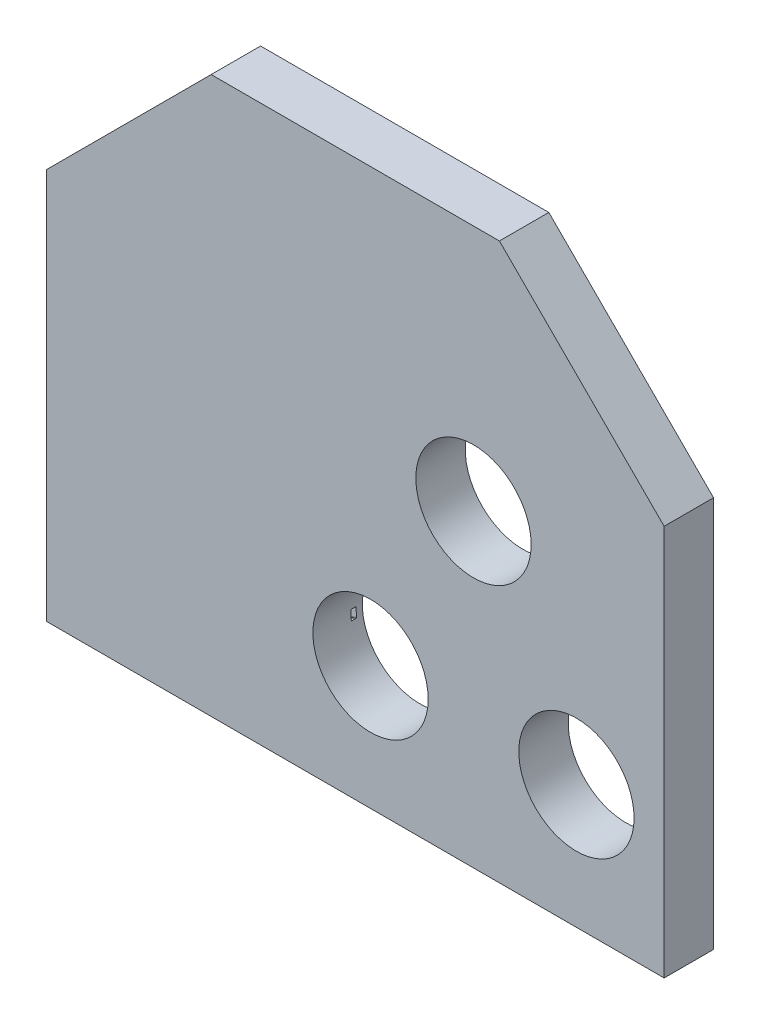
ISO-10303-21;
HEADER;
FILE_DESCRIPTION(('STEP AP214'),'2;1');
FILE_NAME('part.step','',(''),(''),'','','');
FILE_SCHEMA(('AUTOMOTIVE_DESIGN { 1 0 10303 214 1 1 1 1 }'));
ENDSEC;
DATA;
#1=APPLICATION_CONTEXT('core data for automotive mechanical design processes');
#2=APPLICATION_PROTOCOL_DEFINITION('international standard','automotive_design',2000,#1);
#3=PRODUCT_CONTEXT('',#1,'mechanical');
#4=PRODUCT('Part','Part','',(#3));
#5=PRODUCT_RELATED_PRODUCT_CATEGORY('part','',(#4));
#6=PRODUCT_DEFINITION_FORMATION('','',#4);
#7=PRODUCT_DEFINITION_CONTEXT('part definition',#1,'design');
#8=PRODUCT_DEFINITION('design','',#6,#7);
#9=PRODUCT_DEFINITION_SHAPE('','',#8);
#10=(LENGTH_UNIT() NAMED_UNIT(*) SI_UNIT(.MILLI.,.METRE.));
#11=(NAMED_UNIT(*) PLANE_ANGLE_UNIT() SI_UNIT($,.RADIAN.));
#12=(NAMED_UNIT(*) SI_UNIT($,.STERADIAN.) SOLID_ANGLE_UNIT());
#13=UNCERTAINTY_MEASURE_WITH_UNIT(LENGTH_MEASURE(1.E-05),#10,'distance_accuracy_value','');
#14=(GEOMETRIC_REPRESENTATION_CONTEXT(3) GLOBAL_UNCERTAINTY_ASSIGNED_CONTEXT((#13)) GLOBAL_UNIT_ASSIGNED_CONTEXT((#10,
#11,#12)) REPRESENTATION_CONTEXT('',''));
#15=CARTESIAN_POINT('',(0.,0.,0.));
#16=DIRECTION('',(0.,0.,1.));
#17=DIRECTION('',(1.,0.,0.));
#18=AXIS2_PLACEMENT_3D('',#15,#16,#17);
#19=CARTESIAN_POINT('',(78.7,30.,0.));
#20=DIRECTION('',(0.,0.,1.));
#21=DIRECTION('',(1.,0.,0.));
#22=AXIS2_PLACEMENT_3D('',#19,#20,#21);
#23=CYLINDRICAL_SURFACE('',#22,14.);
#24=DIRECTION('',(0.,0.,1.));
#25=VECTOR('',#24,1.);
#26=CARTESIAN_POINT('',(85.4728224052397,42.2527089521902,2.15));
#27=LINE('',#26,#25);
#28=CARTESIAN_POINT('',(85.4728224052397,42.2527089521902,1.5));
#29=VERTEX_POINT('',#28);
#30=CARTESIAN_POINT('',(85.4728224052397,42.2527089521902,2.8));
#31=VERTEX_POINT('',#30);
#32=EDGE_CURVE('E172',#29,#31,#27,.T.);
#33=ORIENTED_EDGE('',*,*,#32,.F.);
#34=CARTESIAN_POINT('',(78.7,30.,1.5));
#35=DIRECTION('',(0.,0.,1.));
#36=DIRECTION('',(1.,0.,0.));
#37=AXIS2_PLACEMENT_3D('',#34,#35,#36);
#38=CIRCLE('',#37,14.);
#39=CARTESIAN_POINT('',(83.5993134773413,43.1147522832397,1.5));
#40=VERTEX_POINT('',#39);
#41=EDGE_CURVE('E194',#40,#29,#38,.F.);
#42=ORIENTED_EDGE('',*,*,#41,.F.);
#43=CARTESIAN_POINT('',(83.4748564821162,43.1605754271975,1.63019999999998));
#44=CARTESIAN_POINT('',(83.4748394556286,43.1605814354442,1.62298749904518));
#45=CARTESIAN_POINT('',(83.4754098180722,43.1603746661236,1.61577663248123));
#46=CARTESIAN_POINT('',(83.4776776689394,43.1595516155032,1.6015671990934));
#47=CARTESIAN_POINT('',(83.4793737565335,43.1589358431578,1.59456837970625));
#48=CARTESIAN_POINT('',(83.4838462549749,43.1573105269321,1.5809711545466));
#49=CARTESIAN_POINT('',(83.4866229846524,43.1563008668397,1.57437286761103));
#50=CARTESIAN_POINT('',(83.4931684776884,43.1539175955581,1.56176125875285));
#51=CARTESIAN_POINT('',(83.4969371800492,43.1525440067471,1.55574790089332));
#52=CARTESIAN_POINT('',(83.5053869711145,43.1494591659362,1.54442227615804));
#53=CARTESIAN_POINT('',(83.5100749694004,43.1477453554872,1.53911586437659));
#54=CARTESIAN_POINT('',(83.5202063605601,43.1440343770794,1.52939774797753));
#55=CARTESIAN_POINT('',(83.5256499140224,43.1420371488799,1.52498623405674));
#56=CARTESIAN_POINT('',(83.5372393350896,43.1377758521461,1.51709974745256));
#57=CARTESIAN_POINT('',(83.5433959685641,43.1355076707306,1.51364282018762));
#58=CARTESIAN_POINT('',(83.5561553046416,43.1307959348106,1.50785687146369));
#59=CARTESIAN_POINT('',(83.5627580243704,43.1283523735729,1.50552789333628));
#60=CARTESIAN_POINT('',(83.5763522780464,43.1233091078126,1.50202074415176));
#61=CARTESIAN_POINT('',(83.5833487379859,43.1207073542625,1.50086459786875));
#62=CARTESIAN_POINT('',(83.5974205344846,43.1154614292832,1.49980612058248));
#63=CARTESIAN_POINT('',(83.6044958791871,43.1128172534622,1.49990392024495));
#64=CARTESIAN_POINT('',(83.6186101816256,43.1075295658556,1.50135807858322));
#65=CARTESIAN_POINT('',(83.625647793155,43.1048864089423,1.50272884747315));
#66=CARTESIAN_POINT('',(83.6394035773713,43.0997078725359,1.5067143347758));
#67=CARTESIAN_POINT('',(83.6461217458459,43.097172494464,1.50932906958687));
#68=CARTESIAN_POINT('',(83.6590359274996,43.0922881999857,1.51573125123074));
#69=CARTESIAN_POINT('',(83.6652326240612,43.0899390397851,1.51951713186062));
#70=CARTESIAN_POINT('',(83.676928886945,43.0854964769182,1.52816348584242));
#71=CARTESIAN_POINT('',(83.6824285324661,43.0834030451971,1.53302383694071));
#72=CARTESIAN_POINT('',(83.6924840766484,43.079569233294,1.54360614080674));
#73=CARTESIAN_POINT('',(83.6970529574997,43.077824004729,1.54931399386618));
#74=CARTESIAN_POINT('',(83.7052063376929,43.0747056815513,1.56148765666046));
#75=CARTESIAN_POINT('',(83.7087906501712,43.0733326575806,1.56795360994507));
#76=CARTESIAN_POINT('',(83.7147895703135,43.0710326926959,1.58130705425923));
#77=CARTESIAN_POINT('',(83.7172278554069,43.0700967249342,1.58818236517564));
#78=CARTESIAN_POINT('',(83.7209637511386,43.0686620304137,1.60226993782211));
#79=CARTESIAN_POINT('',(83.7222632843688,43.0681625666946,1.60948160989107));
#80=CARTESIAN_POINT('',(83.7234146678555,43.067719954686,1.62122203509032));
#81=CARTESIAN_POINT('',(83.7236316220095,43.0676365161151,1.62571238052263));
#82=CARTESIAN_POINT('',(83.723622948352,43.0676398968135,1.6302));
#83=B_SPLINE_CURVE_WITH_KNOTS('',3,(#43,#44,#45,#46,#47,#48,#49,#50,#51,#52,#53,#54,#55,#56,#57,
#58,#59,#60,#61,#62,#63,#64,#65,#66,#67,#68,#69,#70,#71,#72,#73,#74,#75,#76,#77,#78,#79,#80,#81,
#82),.UNSPECIFIED.,.F.,.F.,(4,2,2,2,2,2,2,2,2,2,2,2,2,2,2,2,2,2,2,4),(0.,0.0216072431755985,
0.043187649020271,0.0647744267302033,0.0863598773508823,0.108114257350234,0.129873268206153,
0.152019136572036,0.174165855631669,0.19672117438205,0.219278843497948,0.242095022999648,
0.264911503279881,0.287697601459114,0.310481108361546,0.332921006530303,0.355365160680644,
0.377322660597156,0.39924301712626,0.412705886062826),.UNSPECIFIED.);
#84=CARTESIAN_POINT('',(83.4748563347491,43.1605754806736,1.63));
#85=VERTEX_POINT('',#84);
#86=EDGE_CURVE('E699',#85,#40,#83,.T.);
#87=ORIENTED_EDGE('',*,*,#86,.F.);
#88=DIRECTION('',(0.,0.,1.));
#89=VECTOR('',#88,1.);
#90=CARTESIAN_POINT('',(83.4748563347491,43.1605754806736,2.15));
#91=LINE('',#90,#89);
#92=CARTESIAN_POINT('',(83.4748563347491,43.1605754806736,2.67));
#93=VERTEX_POINT('',#92);
#94=EDGE_CURVE('E316',#93,#85,#91,.F.);
#95=ORIENTED_EDGE('',*,*,#94,.F.);
#96=CARTESIAN_POINT('',(83.723622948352,43.0676398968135,2.6698));
#97=CARTESIAN_POINT('',(83.7236399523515,43.0676331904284,2.67699172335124));
#98=CARTESIAN_POINT('',(83.7230741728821,43.0678508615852,2.68418152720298));
#99=CARTESIAN_POINT('',(83.7208252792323,43.0687151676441,2.69834774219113));
#100=CARTESIAN_POINT('',(83.7191437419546,43.0693611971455,2.70532443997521));
#101=CARTESIAN_POINT('',(83.7147108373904,43.0710627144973,2.71887785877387));
#102=CARTESIAN_POINT('',(83.7119592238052,43.072118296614,2.72545448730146));
#103=CARTESIAN_POINT('',(83.7054741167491,43.0746028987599,2.73802638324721));
#104=CARTESIAN_POINT('',(83.7017406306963,43.0760319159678,2.74402165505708));
#105=CARTESIAN_POINT('',(83.6933594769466,43.079234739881,2.75533198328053));
#106=CARTESIAN_POINT('',(83.6887027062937,43.0810119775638,2.76063931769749));
#107=CARTESIAN_POINT('',(83.6786357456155,43.0848467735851,2.77036450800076));
#108=CARTESIAN_POINT('',(83.6732253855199,43.0869043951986,2.77478216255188));
#109=CARTESIAN_POINT('',(83.6616780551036,43.0912867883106,2.78270398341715));
#110=CARTESIAN_POINT('',(83.6555278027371,43.0936164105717,2.78618610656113));
#111=CARTESIAN_POINT('',(83.6427720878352,43.0984369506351,2.79202074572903));
#112=CARTESIAN_POINT('',(83.6361666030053,43.1009278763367,2.79437320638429));
#113=CARTESIAN_POINT('',(83.6225500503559,43.1060503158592,2.79792541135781));
#114=CARTESIAN_POINT('',(83.6155336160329,43.1086836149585,2.79910203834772));
#115=CARTESIAN_POINT('',(83.6014105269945,43.1139708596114,2.80019211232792));
#116=CARTESIAN_POINT('',(83.5943038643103,43.1166248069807,2.80010544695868));
#117=CARTESIAN_POINT('',(83.5801401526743,43.1219011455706,2.79866325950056));
#118=CARTESIAN_POINT('',(83.573084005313,43.1245230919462,2.79729721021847));
#119=CARTESIAN_POINT('',(83.5592848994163,43.1296383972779,2.79331379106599));
#120=CARTESIAN_POINT('',(83.5525419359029,43.1321317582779,2.79069644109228));
#121=CARTESIAN_POINT('',(83.5396044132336,43.1369051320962,2.78429484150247));
#122=CARTESIAN_POINT('',(83.5334069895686,43.1391862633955,2.78051722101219));
#123=CARTESIAN_POINT('',(83.5217058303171,43.1434847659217,2.77188976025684));
#124=CARTESIAN_POINT('',(83.5162020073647,43.1455021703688,2.76704005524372));
#125=CARTESIAN_POINT('',(83.506142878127,43.1491832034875,2.75648928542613));
#126=CARTESIAN_POINT('',(83.5015735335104,43.1508520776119,2.75080343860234));
#127=CARTESIAN_POINT('',(83.4934148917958,43.1538280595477,2.73868020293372));
#128=CARTESIAN_POINT('',(83.4898257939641,43.1551350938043,2.73224266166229));
#129=CARTESIAN_POINT('',(83.4838024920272,43.1573266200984,2.71893058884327));
#130=CARTESIAN_POINT('',(83.4813479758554,43.1582185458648,2.71206646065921));
#131=CARTESIAN_POINT('',(83.477579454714,43.1595873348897,2.69800211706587));
#132=CARTESIAN_POINT('',(83.4762635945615,43.1600648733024,2.69080246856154));
#133=CARTESIAN_POINT('',(83.4750748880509,43.1604961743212,2.67897572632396));
#134=CARTESIAN_POINT('',(83.4748475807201,43.1605786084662,2.67438648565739));
#135=CARTESIAN_POINT('',(83.4748564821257,43.1605754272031,2.66979999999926));
#136=B_SPLINE_CURVE_WITH_KNOTS('',3,(#96,#97,#98,#99,#100,#101,#102,#103,#104,#105,#106,#107,
#108,#109,#110,#111,#112,#113,#114,#115,#116,#117,#118,#119,#120,#121,#122,#123,#124,#125,#126,
#127,#128,#129,#130,#131,#132,#133,#134,#135),.UNSPECIFIED.,.F.,.F.,(4,2,2,2,2,2,2,2,2,2,2,2,2,
2,2,2,2,2,2,4),(0.,0.0215444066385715,0.0430584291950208,0.0645774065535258,0.086096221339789,
0.107838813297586,0.129586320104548,0.151808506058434,0.174031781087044,0.196683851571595,
0.219337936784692,0.242180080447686,0.265021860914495,0.287735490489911,0.310446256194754,
0.332785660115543,0.355129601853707,0.377056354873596,0.398947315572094,0.412706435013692),.UNSPECIFIED.);
#137=CARTESIAN_POINT('',(83.5993134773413,43.1147522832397,2.8));
#138=VERTEX_POINT('',#137);
#139=EDGE_CURVE('E315',#138,#93,#136,.T.);
#140=ORIENTED_EDGE('',*,*,#139,.F.);
#141=CARTESIAN_POINT('',(78.7,30.,2.8));
#142=DIRECTION('',(0.,0.,-1.));
#143=DIRECTION('',(-1.,0.,0.));
#144=AXIS2_PLACEMENT_3D('',#141,#142,#143);
#145=CIRCLE('',#144,14.);
#146=EDGE_CURVE('E174',#31,#138,#145,.F.);
#147=ORIENTED_EDGE('',*,*,#146,.F.);
#148=EDGE_LOOP('',(#33,#42,#87,#95,#140,#147));
#149=FACE_BOUND('',#148,.T.);
#150=DIRECTION('',(0.,0.,1.));
#151=VECTOR('',#150,1.);
#152=CARTESIAN_POINT('',(64.701892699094,30.2301998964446,2.15));
#153=LINE('',#152,#151);
#154=CARTESIAN_POINT('',(64.701892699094,30.2301998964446,1.5));
#155=VERTEX_POINT('',#154);
#156=CARTESIAN_POINT('',(64.701892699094,30.2301998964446,2.8));
#157=VERTEX_POINT('',#156);
#158=EDGE_CURVE('E281',#155,#157,#153,.T.);
#159=ORIENTED_EDGE('',*,*,#158,.F.);
#160=CARTESIAN_POINT('',(78.7,30.,1.5));
#161=DIRECTION('',(0.,0.,1.));
#162=DIRECTION('',(1.,0.,0.));
#163=AXIS2_PLACEMENT_3D('',#160,#161,#162);
#164=CIRCLE('',#163,14.);
#165=CARTESIAN_POINT('',(64.8386401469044,28.0346239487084,1.5));
#166=VERTEX_POINT('',#165);
#167=EDGE_CURVE('E303',#166,#155,#164,.F.);
#168=ORIENTED_EDGE('',*,*,#167,.F.);
#169=CARTESIAN_POINT('',(64.8586792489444,27.8981341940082,1.6302));
#170=CARTESIAN_POINT('',(64.8586822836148,27.8981152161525,1.62318304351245));
#171=CARTESIAN_POINT('',(64.8585924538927,27.8987057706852,1.61616920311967));
#172=CARTESIAN_POINT('',(64.8582371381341,27.9010470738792,1.60235794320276));
#173=CARTESIAN_POINT('',(64.8579720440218,27.902795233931,1.59556007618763));
#174=CARTESIAN_POINT('',(64.8572762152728,27.9073931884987,1.58235826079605));
#175=CARTESIAN_POINT('',(64.8568454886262,27.9102429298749,1.57595429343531));
#176=CARTESIAN_POINT('',(64.8558358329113,27.9169421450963,1.56370566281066));
#177=CARTESIAN_POINT('',(64.8552568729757,27.9207918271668,1.55786111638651));
#178=CARTESIAN_POINT('',(64.8539572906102,27.9294636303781,1.54674695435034));
#179=CARTESIAN_POINT('',(64.853233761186,27.9343057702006,1.54149332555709));
#180=CARTESIAN_POINT('',(64.8516788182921,27.9447558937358,1.53183197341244));
#181=CARTESIAN_POINT('',(64.8508473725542,27.9503641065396,1.52742450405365));
#182=CARTESIAN_POINT('',(64.8490565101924,27.9625005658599,1.51933333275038));
#183=CARTESIAN_POINT('',(64.8480926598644,27.969061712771,1.51569997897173));
#184=CARTESIAN_POINT('',(64.8461039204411,27.9826723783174,1.50953250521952));
#185=CARTESIAN_POINT('',(64.8450790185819,27.9897219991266,1.50699861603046));
#186=CARTESIAN_POINT('',(64.8429399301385,28.0045188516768,1.50296368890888));
#187=CARTESIAN_POINT('',(64.841823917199,28.0122831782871,1.50152619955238));
#188=CARTESIAN_POINT('',(64.8395869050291,28.0279423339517,1.49993938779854));
#189=CARTESIAN_POINT('',(64.8384659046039,28.0358371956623,1.4997903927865));
#190=CARTESIAN_POINT('',(64.8362098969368,28.0518235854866,1.50079777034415));
#191=CARTESIAN_POINT('',(64.8350757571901,28.0599124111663,1.50199969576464));
#192=CARTESIAN_POINT('',(64.8328649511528,28.0757781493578,1.50575938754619));
#193=CARTESIAN_POINT('',(64.8317882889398,28.08355503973,1.50831724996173));
#194=CARTESIAN_POINT('',(64.8297246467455,28.0985482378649,1.51473255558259));
#195=CARTESIAN_POINT('',(64.8287374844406,28.1057656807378,1.51858727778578));
#196=CARTESIAN_POINT('',(64.8268796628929,28.11942040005,1.52751619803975));
#197=CARTESIAN_POINT('',(64.8260089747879,28.1258578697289,1.53259009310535));
#198=CARTESIAN_POINT('',(64.8244463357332,28.1374631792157,1.54359379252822));
#199=CARTESIAN_POINT('',(64.8237483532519,28.1426734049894,1.5494779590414));
#200=CARTESIAN_POINT('',(64.8225083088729,28.1519614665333,1.56209923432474));
#201=CARTESIAN_POINT('',(64.8219662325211,28.1560394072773,1.56883626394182));
#202=CARTESIAN_POINT('',(64.8210873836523,28.1626663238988,1.58250532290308));
#203=CARTESIAN_POINT('',(64.8207397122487,28.1652963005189,1.58939743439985));
#204=CARTESIAN_POINT('',(64.8202119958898,28.1692926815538,1.60353408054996));
#205=CARTESIAN_POINT('',(64.8200316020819,28.1706617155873,1.61077784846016));
#206=CARTESIAN_POINT('',(64.8198856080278,28.1717702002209,1.62210953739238));
#207=CARTESIAN_POINT('',(64.8198599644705,28.1719650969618,1.62615606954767));
#208=CARTESIAN_POINT('',(64.8198611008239,28.171956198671,1.6302));
#209=B_SPLINE_CURVE_WITH_KNOTS('',3,(#169,#170,#171,#172,#173,#174,#175,#176,#177,#178,#179,
#180,#181,#182,#183,#184,#185,#186,#187,#188,#189,#190,#191,#192,#193,#194,#195,#196,#197,#198,
#199,#200,#201,#202,#203,#204,#205,#206,#207,#208),.UNSPECIFIED.,.F.,.F.,(4,2,2,2,2,2,2,2,2,2,2,
2,2,2,2,2,2,2,2,4),(0.,0.0210182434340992,0.0419896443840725,0.0629600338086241,
0.0839347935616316,0.105383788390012,0.126839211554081,0.149424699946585,0.172014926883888,
0.195831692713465,0.219654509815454,0.244305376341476,0.268957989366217,0.293559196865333,
0.318154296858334,0.341702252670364,0.365248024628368,0.387290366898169,0.409286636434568,
0.421419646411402),.UNSPECIFIED.);
#210=CARTESIAN_POINT('',(64.858679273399,27.8981340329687,1.63));
#211=VERTEX_POINT('',#210);
#212=EDGE_CURVE('E299',#211,#166,#209,.T.);
#213=ORIENTED_EDGE('',*,*,#212,.F.);
#214=DIRECTION('',(0.,0.,1.));
#215=VECTOR('',#214,1.);
#216=CARTESIAN_POINT('',(64.858679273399,27.8981340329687,2.15));
#217=LINE('',#216,#215);
#218=CARTESIAN_POINT('',(64.858679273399,27.8981340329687,2.67));
#219=VERTEX_POINT('',#218);
#220=EDGE_CURVE('E256',#219,#211,#217,.F.);
#221=ORIENTED_EDGE('',*,*,#220,.F.);
#222=CARTESIAN_POINT('',(64.8198611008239,28.171956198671,2.6698));
#223=CARTESIAN_POINT('',(64.8198586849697,28.1719756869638,2.67677711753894));
#224=CARTESIAN_POINT('',(64.8199364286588,28.1713842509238,2.68375057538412));
#225=CARTESIAN_POINT('',(64.8202450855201,28.1690423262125,2.69747908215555));
#226=CARTESIAN_POINT('',(64.8204756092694,28.1672947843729,2.70423464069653));
#227=CARTESIAN_POINT('',(64.8210826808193,28.1627033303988,2.71735250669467));
#228=CARTESIAN_POINT('',(64.8214592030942,28.1598596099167,2.7237148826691));
#229=CARTESIAN_POINT('',(64.8223462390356,28.1531817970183,2.73588669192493));
#230=CARTESIAN_POINT('',(64.82285679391,28.1493474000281,2.74169595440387));
#231=CARTESIAN_POINT('',(64.8240129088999,28.1406985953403,2.75277588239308));
#232=CARTESIAN_POINT('',(64.8246617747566,28.1358602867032,2.75802750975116));
#233=CARTESIAN_POINT('',(64.826067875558,28.1254240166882,2.76769455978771));
#234=CARTESIAN_POINT('',(64.826825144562,28.1198258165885,2.7721097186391));
#235=CARTESIAN_POINT('',(64.8284782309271,28.1076671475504,2.78026226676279));
#236=CARTESIAN_POINT('',(64.8293796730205,28.1010688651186,2.7839421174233));
#237=CARTESIAN_POINT('',(64.8312605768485,28.0873801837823,2.7902006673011));
#238=CARTESIAN_POINT('',(64.8322400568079,28.080289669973,2.79277910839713));
#239=CARTESIAN_POINT('',(64.8343108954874,28.0653875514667,2.79690520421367));
#240=CARTESIAN_POINT('',(64.835405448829,28.057557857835,2.79838609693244));
#241=CARTESIAN_POINT('',(64.8376271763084,28.0417652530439,2.80004182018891));
#242=CARTESIAN_POINT('',(64.838754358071,28.0338023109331,2.80021634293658));
#243=CARTESIAN_POINT('',(64.8410444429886,28.0177238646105,2.79923839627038));
#244=CARTESIAN_POINT('',(64.8422074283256,28.0096106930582,2.79804703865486));
#245=CARTESIAN_POINT('',(64.8445015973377,27.993702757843,2.79429081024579));
#246=CARTESIAN_POINT('',(64.8456327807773,27.9859079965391,2.79172592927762));
#247=CARTESIAN_POINT('',(64.8478143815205,27.9709583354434,2.78530518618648));
#248=CARTESIAN_POINT('',(64.8488655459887,27.9637973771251,2.78146372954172));
#249=CARTESIAN_POINT('',(64.8508626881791,27.9502579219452,2.77256507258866));
#250=CARTESIAN_POINT('',(64.851808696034,27.9438792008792,2.7675082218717));
#251=CARTESIAN_POINT('',(64.8535171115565,27.932406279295,2.75656329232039));
#252=CARTESIAN_POINT('',(64.8542859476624,27.9272665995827,2.7507239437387));
#253=CARTESIAN_POINT('',(64.8556610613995,27.918101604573,2.73820743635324));
#254=CARTESIAN_POINT('',(64.8562673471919,27.9140762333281,2.73153031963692));
#255=CARTESIAN_POINT('',(64.8572596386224,27.9075015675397,2.71794831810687));
#256=CARTESIAN_POINT('',(64.8576563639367,27.9048803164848,2.71107899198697));
#257=CARTESIAN_POINT('',(64.8582622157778,27.9008812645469,2.69699002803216));
#258=CARTESIAN_POINT('',(64.8584717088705,27.8995010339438,2.68977110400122));
#259=CARTESIAN_POINT('',(64.8586485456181,27.8983364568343,2.67827332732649));
#260=CARTESIAN_POINT('',(64.858680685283,27.8981249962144,2.67403532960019));
#261=CARTESIAN_POINT('',(64.8586792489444,27.8981341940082,2.6698));
#262=B_SPLINE_CURVE_WITH_KNOTS('',3,(#222,#223,#224,#225,#226,#227,#228,#229,#230,#231,#232,
#233,#234,#235,#236,#237,#238,#239,#240,#241,#242,#243,#244,#245,#246,#247,#248,#249,#250,#251,
#252,#253,#254,#255,#256,#257,#258,#259,#260,#261),.UNSPECIFIED.,.F.,.F.,(4,2,2,2,2,2,2,2,2,2,2,
2,2,2,2,2,2,2,2,4),(0.,0.0208977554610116,0.0417424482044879,0.0625834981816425,
0.0834309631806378,0.104847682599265,0.12627114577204,0.148997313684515,0.171728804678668,
0.195749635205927,0.219776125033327,0.244504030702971,0.269232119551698,0.293690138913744,
0.318141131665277,0.341471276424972,0.364800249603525,0.386778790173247,0.408714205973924,
0.421420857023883),.UNSPECIFIED.);
#263=CARTESIAN_POINT('',(64.8386401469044,28.0346239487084,2.8));
#264=VERTEX_POINT('',#263);
#265=EDGE_CURVE('E249',#264,#219,#262,.T.);
#266=ORIENTED_EDGE('',*,*,#265,.F.);
#267=CARTESIAN_POINT('',(78.7,30.,2.8));
#268=DIRECTION('',(0.,0.,-1.));
#269=DIRECTION('',(-1.,0.,0.));
#270=AXIS2_PLACEMENT_3D('',#267,#268,#269);
#271=CIRCLE('',#270,14.);
#272=EDGE_CURVE('E247',#157,#264,#271,.F.);
#273=ORIENTED_EDGE('',*,*,#272,.F.);
#274=EDGE_LOOP('',(#159,#168,#213,#221,#266,#273));
#275=FACE_BOUND('',#274,.T.);
#276=CARTESIAN_POINT('',(78.7,30.,0.));
#277=DIRECTION('',(0.,0.,1.));
#278=DIRECTION('',(1.,0.,0.));
#279=AXIS2_PLACEMENT_3D('',#276,#277,#278);
#280=CIRCLE('',#279,14.);
#281=CARTESIAN_POINT('',(92.7,30.,0.));
#282=VERTEX_POINT('',#281);
#283=EDGE_CURVE('E390',#282,#282,#280,.T.);
#284=ORIENTED_EDGE('',*,*,#283,.F.);
#285=EDGE_LOOP('',(#284));
#286=FACE_BOUND('',#285,.T.);
#287=CARTESIAN_POINT('',(78.7,30.,12.));
#288=DIRECTION('',(0.,0.,1.));
#289=DIRECTION('',(1.,0.,0.));
#290=AXIS2_PLACEMENT_3D('',#287,#288,#289);
#291=CIRCLE('',#290,14.);
#292=CARTESIAN_POINT('',(92.7,30.,12.));
#293=VERTEX_POINT('',#292);
#294=EDGE_CURVE('E387',#293,#293,#291,.T.);
#295=ORIENTED_EDGE('',*,*,#294,.T.);
#296=EDGE_LOOP('',(#295));
#297=FACE_BOUND('',#296,.T.);
#298=DIRECTION('',(0.,0.,1.));
#299=VECTOR('',#298,1.);
#300=CARTESIAN_POINT('',(70.5896147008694,41.4114701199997,2.15));
#301=LINE('',#300,#299);
#302=CARTESIAN_POINT('',(70.5896147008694,41.4114701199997,2.8));
#303=VERTEX_POINT('',#302);
#304=CARTESIAN_POINT('',(70.5896147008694,41.4114701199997,1.5));
#305=VERTEX_POINT('',#304);
#306=EDGE_CURVE('E290',#303,#305,#301,.F.);
#307=ORIENTED_EDGE('',*,*,#306,.F.);
#308=CARTESIAN_POINT('',(72.4772879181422,42.541046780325,2.8));
#309=VERTEX_POINT('',#308);
#310=EDGE_CURVE('E250',#309,#303,#271,.F.);
#311=ORIENTED_EDGE('',*,*,#310,.F.);
#312=CARTESIAN_POINT('',(72.6011652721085,42.6017544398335,2.6698));
#313=CARTESIAN_POINT('',(72.6011826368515,42.601762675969,2.67681695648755));
#314=CARTESIAN_POINT('',(72.6006448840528,42.6015025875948,2.68383079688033));
#315=CARTESIAN_POINT('',(72.5985133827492,42.6004707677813,2.69764205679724));
#316=CARTESIAN_POINT('',(72.5969219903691,42.5997001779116,2.70443992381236));
#317=CARTESIAN_POINT('',(72.5927371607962,42.5976722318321,2.71764173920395));
#318=CARTESIAN_POINT('',(72.5901437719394,42.5964148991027,2.72404570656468));
#319=CARTESIAN_POINT('',(72.5840488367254,42.5934567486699,2.73629433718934));
#320=CARTESIAN_POINT('',(72.5805471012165,42.5917558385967,2.74213888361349));
#321=CARTESIAN_POINT('',(72.5726616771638,42.5879205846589,2.75325304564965));
#322=CARTESIAN_POINT('',(72.5682598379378,42.585777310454,2.75850667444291));
#323=CARTESIAN_POINT('',(72.5587636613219,42.5811463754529,2.76816802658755));
#324=CARTESIAN_POINT('',(72.5536691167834,42.5786586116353,2.77257549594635));
#325=CARTESIAN_POINT('',(72.5426490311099,42.5732680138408,2.78066666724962));
#326=CARTESIAN_POINT('',(72.5366938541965,42.5703502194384,2.78430002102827));
#327=CARTESIAN_POINT('',(72.5243462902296,42.5642886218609,2.79046749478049));
#328=CARTESIAN_POINT('',(72.5179538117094,42.5611447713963,2.79300138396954));
#329=CARTESIAN_POINT('',(72.5045431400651,42.5545359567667,2.79703631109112));
#330=CARTESIAN_POINT('',(72.4975098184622,42.5510628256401,2.79847380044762));
#331=CARTESIAN_POINT('',(72.4833327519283,42.5440468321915,2.80006061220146));
#332=CARTESIAN_POINT('',(72.4761889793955,42.5405039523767,2.8002096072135));
#333=CARTESIAN_POINT('',(72.4617313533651,42.5333184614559,2.79920222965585));
#334=CARTESIAN_POINT('',(72.4544202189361,42.5296766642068,2.79800030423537));
#335=CARTESIAN_POINT('',(72.4400876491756,42.5225221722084,2.79424061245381));
#336=CARTESIAN_POINT('',(72.4330662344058,42.5190094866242,2.79168275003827));
#337=CARTESIAN_POINT('',(72.419536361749,42.5122273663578,2.78526744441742));
#338=CARTESIAN_POINT('',(72.4130268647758,42.5089574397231,2.78141272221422));
#339=CARTESIAN_POINT('',(72.40071705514,42.5027629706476,2.77248380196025));
#340=CARTESIAN_POINT('',(72.3949165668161,42.4998383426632,2.76740990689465));
#341=CARTESIAN_POINT('',(72.3844635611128,42.4945601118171,2.75640620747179));
#342=CARTESIAN_POINT('',(72.3797726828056,42.4921874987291,2.75052204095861));
#343=CARTESIAN_POINT('',(72.3714128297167,42.4879544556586,2.73790076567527));
#344=CARTESIAN_POINT('',(72.3677437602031,42.4860939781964,2.73116373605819));
#345=CARTESIAN_POINT('',(72.3617824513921,42.4830688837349,2.71749467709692));
#346=CARTESIAN_POINT('',(72.3594172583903,42.4818674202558,2.71060256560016));
#347=CARTESIAN_POINT('',(72.3558235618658,42.4800412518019,2.69646591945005));
#348=CARTESIAN_POINT('',(72.3545926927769,42.4794153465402,2.68922215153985));
#349=CARTESIAN_POINT('',(72.353596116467,42.4789085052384,2.67789046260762));
#350=CARTESIAN_POINT('',(72.3534209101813,42.4788193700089,2.67384393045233));
#351=CARTESIAN_POINT('',(72.3534288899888,42.4788234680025,2.6698));
#352=B_SPLINE_CURVE_WITH_KNOTS('',3,(#312,#313,#314,#315,#316,#317,#318,#319,#320,#321,#322,
#323,#324,#325,#326,#327,#328,#329,#330,#331,#332,#333,#334,#335,#336,#337,#338,#339,#340,#341,
#342,#343,#344,#345,#346,#347,#348,#349,#350,#351),.UNSPECIFIED.,.F.,.F.,(4,2,2,2,2,2,2,2,2,2,2,
2,2,2,2,2,2,2,2,4),(0.,0.0210182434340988,0.0419896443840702,0.0629600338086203,
0.0839347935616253,0.105383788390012,0.12683921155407,0.149424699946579,0.172014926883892,
0.195831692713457,0.219654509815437,0.244305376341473,0.26895798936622,0.29355919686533,
0.318154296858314,0.341702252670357,0.365248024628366,0.38729036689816,0.409286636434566,
0.421419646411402),.UNSPECIFIED.);
#353=CARTESIAN_POINT('',(72.601165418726,42.6017545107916,2.67));
#354=VERTEX_POINT('',#353);
#355=EDGE_CURVE('E273',#354,#309,#352,.T.);
#356=ORIENTED_EDGE('',*,*,#355,.F.);
#357=DIRECTION('',(0.,0.,1.));
#358=VECTOR('',#357,1.);
#359=CARTESIAN_POINT('',(72.601165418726,42.6017545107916,2.15));
#360=LINE('',#359,#358);
#361=CARTESIAN_POINT('',(72.601165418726,42.6017545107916,1.63));
#362=VERTEX_POINT('',#361);
#363=EDGE_CURVE('E280',#362,#354,#360,.T.);
#364=ORIENTED_EDGE('',*,*,#363,.F.);
#365=CARTESIAN_POINT('',(72.3534288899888,42.4788234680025,1.6302));
#366=CARTESIAN_POINT('',(72.3534114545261,42.4788144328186,1.62322288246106));
#367=CARTESIAN_POINT('',(72.3539430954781,42.4790849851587,1.61624942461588));
#368=CARTESIAN_POINT('',(72.3560487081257,42.4801556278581,1.60252091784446));
#369=CARTESIAN_POINT('',(72.3576200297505,42.480954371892,1.59576535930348));
#370=CARTESIAN_POINT('',(72.3617492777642,42.4830518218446,1.58264749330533));
#371=CARTESIAN_POINT('',(72.3643070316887,42.4843504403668,1.5762851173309));
#372=CARTESIAN_POINT('',(72.3703149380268,42.4873975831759,1.56411330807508));
#373=CARTESIAN_POINT('',(72.3737653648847,42.489146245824,1.55830404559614));
#374=CARTESIAN_POINT('',(72.3815506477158,42.4930867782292,1.54722411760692));
#375=CARTESIAN_POINT('',(72.3859070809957,42.4952894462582,1.54197249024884));
#376=CARTESIAN_POINT('',(72.3953076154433,42.500035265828,1.53230544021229));
#377=CARTESIAN_POINT('',(72.4003519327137,42.5025785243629,1.5278902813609));
#378=CARTESIAN_POINT('',(72.4113123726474,42.5080952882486,1.5197377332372));
#379=CARTESIAN_POINT('',(72.4172628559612,42.5110855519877,1.51605788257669));
#380=CARTESIAN_POINT('',(72.4296137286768,42.5172802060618,1.50979933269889));
#381=CARTESIAN_POINT('',(72.4360142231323,42.5204846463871,1.50722089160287));
#382=CARTESIAN_POINT('',(72.4494730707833,42.527209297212,1.50309479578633));
#383=CARTESIAN_POINT('',(72.4565481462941,42.5307371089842,1.50161390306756));
#384=CARTESIAN_POINT('',(72.4708265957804,42.5378412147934,1.49995817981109));
#385=CARTESIAN_POINT('',(72.4780299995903,42.5414175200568,1.49978365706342));
#386=CARTESIAN_POINT('',(72.492582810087,42.5486270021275,1.50076160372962));
#387=CARTESIAN_POINT('',(72.4999303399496,42.55225879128,1.50195296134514));
#388=CARTESIAN_POINT('',(72.5143448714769,42.559368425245,1.5057091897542));
#389=CARTESIAN_POINT('',(72.5214118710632,42.5628462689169,1.50827407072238));
#390=CARTESIAN_POINT('',(72.5349725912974,42.5695064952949,1.51469481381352));
#391=CARTESIAN_POINT('',(72.5414717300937,42.5726916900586,1.51853627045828));
#392=CARTESIAN_POINT('',(72.5537653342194,42.5787060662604,1.52743492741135));
#393=CARTESIAN_POINT('',(72.55956000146,42.5815353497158,1.5324917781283));
#394=CARTESIAN_POINT('',(72.5699863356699,42.5866184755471,1.54343670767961));
#395=CARTESIAN_POINT('',(72.5746591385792,42.5888927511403,1.54927605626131));
#396=CARTESIAN_POINT('',(72.5829939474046,42.5929447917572,1.56179256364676));
#397=CARTESIAN_POINT('',(72.5866560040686,42.5947225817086,1.56846968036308));
#398=CARTESIAN_POINT('',(72.5926384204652,42.5976245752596,1.58205168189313));
#399=CARTESIAN_POINT('',(72.5950241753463,42.5987806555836,1.58892100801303));
#400=CARTESIAN_POINT('',(72.5986642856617,42.6005439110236,1.60300997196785));
#401=CARTESIAN_POINT('',(72.5999208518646,42.6011521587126,1.61022889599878));
#402=CARTESIAN_POINT('',(72.6009811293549,42.6016653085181,1.62172667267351));
#403=CARTESIAN_POINT('',(72.6011736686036,42.6017584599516,1.62596467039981));
#404=CARTESIAN_POINT('',(72.6011652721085,42.6017544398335,1.6302));
#405=B_SPLINE_CURVE_WITH_KNOTS('',3,(#365,#366,#367,#368,#369,#370,#371,#372,#373,#374,#375,
#376,#377,#378,#379,#380,#381,#382,#383,#384,#385,#386,#387,#388,#389,#390,#391,#392,#393,#394,
#395,#396,#397,#398,#399,#400,#401,#402,#403,#404),.UNSPECIFIED.,.F.,.F.,(4,2,2,2,2,2,2,2,2,2,2,
2,2,2,2,2,2,2,2,4),(0.,0.0208977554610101,0.041742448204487,0.0625834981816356,
0.0834309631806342,0.104847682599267,0.126271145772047,0.148997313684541,0.171728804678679,
0.19574963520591,0.219776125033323,0.244504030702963,0.269232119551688,0.293690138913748,
0.318141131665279,0.341471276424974,0.364800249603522,0.386778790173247,0.408714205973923,
0.421420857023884),.UNSPECIFIED.);
#406=CARTESIAN_POINT('',(72.4772879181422,42.541046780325,1.5));
#407=VERTEX_POINT('',#406);
#408=EDGE_CURVE('E284',#407,#362,#405,.T.);
#409=ORIENTED_EDGE('',*,*,#408,.F.);
#410=EDGE_CURVE('E289',#305,#407,#164,.F.);
#411=ORIENTED_EDGE('',*,*,#410,.F.);
#412=EDGE_LOOP('',(#307,#311,#356,#364,#409,#411));
#413=FACE_BOUND('',#412,.T.);
#414=DIRECTION('',(0.,0.,1.));
#415=VECTOR('',#414,1.);
#416=CARTESIAN_POINT('',(92.6900963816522,29.4734990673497,2.15));
#417=LINE('',#416,#415);
#418=CARTESIAN_POINT('',(92.6900963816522,29.4734990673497,2.8));
#419=VERTEX_POINT('',#418);
#420=CARTESIAN_POINT('',(92.6900963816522,29.4734990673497,1.5));
#421=VERTEX_POINT('',#420);
#422=EDGE_CURVE('E178',#419,#421,#417,.F.);
#423=ORIENTED_EDGE('',*,*,#422,.F.);
#424=CARTESIAN_POINT('',(92.460958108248,27.4239503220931,2.8));
#425=VERTEX_POINT('',#424);
#426=EDGE_CURVE('E160',#425,#419,#145,.F.);
#427=ORIENTED_EDGE('',*,*,#426,.F.);
#428=CARTESIAN_POINT('',(92.4359375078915,27.2937071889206,2.66980000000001));
#429=CARTESIAN_POINT('',(92.4359338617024,27.2936895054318,2.67701250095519));
#430=CARTESIAN_POINT('',(92.4360512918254,27.2942847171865,2.68422336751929));
#431=CARTESIAN_POINT('',(92.4365174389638,27.2966518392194,2.69843280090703));
#432=CARTESIAN_POINT('',(92.4368658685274,27.298422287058,2.70543162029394));
#433=CARTESIAN_POINT('',(92.4377833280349,27.3030916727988,2.71902884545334));
#434=CARTESIAN_POINT('',(92.4383524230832,27.3059909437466,2.7256271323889));
#435=CARTESIAN_POINT('',(92.4396911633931,27.312826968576,2.73823874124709));
#436=CARTESIAN_POINT('',(92.4404607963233,27.3167636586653,2.74425209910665));
#437=CARTESIAN_POINT('',(92.4421819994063,27.3255927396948,2.75557772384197));
#438=CARTESIAN_POINT('',(92.4431349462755,27.3304923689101,2.76088413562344));
#439=CARTESIAN_POINT('',(92.4451882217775,27.3410848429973,2.7706022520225));
#440=CARTESIAN_POINT('',(92.4462885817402,27.346777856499,2.77501376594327));
#441=CARTESIAN_POINT('',(92.448623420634,27.3589031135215,2.78290025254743));
#442=CARTESIAN_POINT('',(92.4498599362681,27.3653467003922,2.78635717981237));
#443=CARTESIAN_POINT('',(92.452413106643,27.3787064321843,2.79214312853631));
#444=CARTESIAN_POINT('',(92.4537297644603,27.3856225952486,2.79447210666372));
#445=CARTESIAN_POINT('',(92.4564301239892,27.3998685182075,2.79797925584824));
#446=CARTESIAN_POINT('',(92.457814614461,27.4072035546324,2.79913540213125));
#447=CARTESIAN_POINT('',(92.4605879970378,27.4219630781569,2.80019387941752));
#448=CARTESIAN_POINT('',(92.4619768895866,27.4293875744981,2.80009607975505));
#449=CARTESIAN_POINT('',(92.4647364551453,27.4442050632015,2.79864192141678));
#450=CARTESIAN_POINT('',(92.466106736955,27.4515967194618,2.79727115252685));
#451=CARTESIAN_POINT('',(92.4687746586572,27.4660508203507,2.79328566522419));
#452=CARTESIAN_POINT('',(92.470072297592,27.4731132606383,2.79067093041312));
#453=CARTESIAN_POINT('',(92.472557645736,27.4866946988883,2.78426874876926));
#454=CARTESIAN_POINT('',(92.4737454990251,27.4932144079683,2.78048286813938));
#455=CARTESIAN_POINT('',(92.4759802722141,27.5055247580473,2.77183651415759));
#456=CARTESIAN_POINT('',(92.4770272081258,27.5113154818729,2.7669761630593));
#457=CARTESIAN_POINT('',(92.4789361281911,27.521906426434,2.75639385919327));
#458=CARTESIAN_POINT('',(92.4798006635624,27.526720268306,2.75068600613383));
#459=CARTESIAN_POINT('',(92.4813401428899,27.5353127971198,2.73851234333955));
#460=CARTESIAN_POINT('',(92.4820150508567,27.5390912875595,2.73204639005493));
#461=CARTESIAN_POINT('',(92.4831429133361,27.5454162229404,2.71869294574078));
#462=CARTESIAN_POINT('',(92.4836003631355,27.5479876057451,2.71181763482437));
#463=CARTESIAN_POINT('',(92.4843007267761,27.5519277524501,2.6977300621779));
#464=CARTESIAN_POINT('',(92.4845440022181,27.5532985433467,2.69051839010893));
#465=CARTESIAN_POINT('',(92.4847594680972,27.5545131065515,2.6787779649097));
#466=CARTESIAN_POINT('',(92.4848000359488,27.5547419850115,2.67428761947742));
#467=CARTESIAN_POINT('',(92.4847984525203,27.5547328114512,2.66980000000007));
#468=B_SPLINE_CURVE_WITH_KNOTS('',3,(#428,#429,#430,#431,#432,#433,#434,#435,#436,#437,#438,
#439,#440,#441,#442,#443,#444,#445,#446,#447,#448,#449,#450,#451,#452,#453,#454,#455,#456,#457,
#458,#459,#460,#461,#462,#463,#464,#465,#466,#467),.UNSPECIFIED.,.F.,.F.,(4,2,2,2,2,2,2,2,2,2,2,
2,2,2,2,2,2,2,2,4),(0.,0.0216072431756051,0.043187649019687,0.0647744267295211,
0.0863598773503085,0.108114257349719,0.129873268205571,0.152019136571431,0.174165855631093,
0.196721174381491,0.219278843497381,0.242095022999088,0.264911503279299,0.287697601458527,
0.310481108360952,0.332921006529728,0.355365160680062,0.377322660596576,0.399243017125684,
0.41270588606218),.UNSPECIFIED.);
#469=CARTESIAN_POINT('',(92.4359374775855,27.2937070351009,2.67));
#470=VERTEX_POINT('',#469);
#471=EDGE_CURVE('E171',#470,#425,#468,.T.);
#472=ORIENTED_EDGE('',*,*,#471,.F.);
#473=DIRECTION('',(0.,0.,1.));
#474=VECTOR('',#473,1.);
#475=CARTESIAN_POINT('',(92.4359374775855,27.2937070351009,2.15));
#476=LINE('',#475,#474);
#477=CARTESIAN_POINT('',(92.4359374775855,27.2937070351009,1.63));
#478=VERTEX_POINT('',#477);
#479=EDGE_CURVE('E338',#478,#470,#476,.T.);
#480=ORIENTED_EDGE('',*,*,#479,.F.);
#481=CARTESIAN_POINT('',(92.4847984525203,27.5547328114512,1.63019999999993));
#482=CARTESIAN_POINT('',(92.4848014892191,27.5547508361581,1.62300827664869));
#483=CARTESIAN_POINT('',(92.4846957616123,27.5541539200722,1.61581847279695));
#484=CARTESIAN_POINT('',(92.4842747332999,27.5517817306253,1.6016522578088));
#485=CARTESIAN_POINT('',(92.4839597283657,27.5500081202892,1.59467556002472));
#486=CARTESIAN_POINT('',(92.4831279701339,27.5453332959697,1.58112214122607));
#487=CARTESIAN_POINT('',(92.4826111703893,27.542431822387,1.57454551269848));
#488=CARTESIAN_POINT('',(92.4813903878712,27.5355951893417,1.56197361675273));
#489=CARTESIAN_POINT('',(92.4806864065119,27.5316600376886,1.55597834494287));
#490=CARTESIAN_POINT('',(92.4791016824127,27.522828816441,1.54466801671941));
#491=CARTESIAN_POINT('',(92.4782191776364,27.5179231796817,1.53936068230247));
#492=CARTESIAN_POINT('',(92.4763052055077,27.5073219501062,1.5296354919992));
#493=CARTESIAN_POINT('',(92.4752737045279,27.5016261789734,1.52521783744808));
#494=CARTESIAN_POINT('',(92.4730643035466,27.4894744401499,1.51729601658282));
#495=CARTESIAN_POINT('',(92.4718836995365,27.483004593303,1.51381389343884));
#496=CARTESIAN_POINT('',(92.4694255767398,27.4695917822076,1.50797925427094));
#497=CARTESIAN_POINT('',(92.4681480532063,27.462648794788,1.50562679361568));
#498=CARTESIAN_POINT('',(92.4655039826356,27.4483428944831,1.50207458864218));
#499=CARTESIAN_POINT('',(92.4641361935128,27.4409744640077,1.50089796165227));
#500=CARTESIAN_POINT('',(92.4613717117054,27.4261496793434,1.49980788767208));
#501=CARTESIAN_POINT('',(92.459975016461,27.4186933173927,1.49989455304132));
#502=CARTESIAN_POINT('',(92.4571802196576,27.4038393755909,1.50133674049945));
#503=CARTESIAN_POINT('',(92.455782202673,27.396442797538,1.50270278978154));
#504=CARTESIAN_POINT('',(92.453037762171,27.3819842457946,1.50668620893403));
#505=CARTESIAN_POINT('',(92.4516913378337,27.3749222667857,1.50930355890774));
#506=CARTESIAN_POINT('',(92.4490989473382,27.3613781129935,1.51570515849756));
#507=CARTESIAN_POINT('',(92.4478524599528,27.3548929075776,1.51948277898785));
#508=CARTESIAN_POINT('',(92.4454917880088,27.3426527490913,1.52811023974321));
#509=CARTESIAN_POINT('',(92.4443775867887,27.3368977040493,1.53295994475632));
#510=CARTESIAN_POINT('',(92.4423359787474,27.3263825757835,1.54351071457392));
#511=CARTESIAN_POINT('',(92.441405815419,27.3216077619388,1.54919656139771));
#512=CARTESIAN_POINT('',(92.439741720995,27.3130842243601,1.56131979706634));
#513=CARTESIAN_POINT('',(92.4390078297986,27.3093357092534,1.56775733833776));
#514=CARTESIAN_POINT('',(92.4377745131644,27.3030458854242,1.58106941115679));
#515=CARTESIAN_POINT('',(92.4372709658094,27.3004833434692,1.58793353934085));
#516=CARTESIAN_POINT('',(92.4364973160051,27.2965492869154,1.60199788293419));
#517=CARTESIAN_POINT('',(92.4362268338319,27.2951758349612,1.60919753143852));
#518=CARTESIAN_POINT('',(92.4359824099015,27.2939351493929,1.62102427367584));
#519=CARTESIAN_POINT('',(92.435935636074,27.2936979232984,1.62561351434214));
#520=CARTESIAN_POINT('',(92.4359375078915,27.2937071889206,1.63019999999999));
#521=B_SPLINE_CURVE_WITH_KNOTS('',3,(#481,#482,#483,#484,#485,#486,#487,#488,#489,#490,#491,
#492,#493,#494,#495,#496,#497,#498,#499,#500,#501,#502,#503,#504,#505,#506,#507,#508,#509,#510,
#511,#512,#513,#514,#515,#516,#517,#518,#519,#520),.UNSPECIFIED.,.F.,.F.,(4,2,2,2,2,2,2,2,2,2,2,
2,2,2,2,2,2,2,2,4),(0.,0.0215444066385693,0.0430584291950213,0.0645774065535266,
0.0860962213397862,0.107838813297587,0.129586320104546,0.151808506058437,0.174031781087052,
0.196683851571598,0.219337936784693,0.24218008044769,0.265021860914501,0.287735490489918,
0.31044625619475,0.332785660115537,0.355129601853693,0.377056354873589,0.398947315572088,
0.412706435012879),.UNSPECIFIED.);
#522=CARTESIAN_POINT('',(92.460958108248,27.4239503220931,1.5));
#523=VERTEX_POINT('',#522);
#524=EDGE_CURVE('E192',#523,#478,#521,.T.);
#525=ORIENTED_EDGE('',*,*,#524,.F.);
#526=EDGE_CURVE('E186',#421,#523,#38,.F.);
#527=ORIENTED_EDGE('',*,*,#526,.F.);
#528=EDGE_LOOP('',(#423,#427,#472,#480,#525,#527));
#529=FACE_BOUND('',#528,.T.);
#530=ADVANCED_FACE('F34',(#149,#275,#286,#297,#413,#529),#23,.F.);
#531=CARTESIAN_POINT('',(0.,0.,12.));
#532=DIRECTION('',(1.,0.,0.));
#533=DIRECTION('',(0.,0.,-1.));
#534=AXIS2_PLACEMENT_3D('',#531,#532,#533);
#535=PLANE('',#534);
#536=DIRECTION('',(0.,-1.,0.));
#537=VECTOR('',#536,1.);
#538=CARTESIAN_POINT('',(0.,0.,12.));
#539=LINE('',#538,#537);
#540=CARTESIAN_POINT('',(0.,95.,12.));
#541=VERTEX_POINT('',#540);
#542=CARTESIAN_POINT('',(0.,0.,12.));
#543=VERTEX_POINT('',#542);
#544=EDGE_CURVE('E215',#541,#543,#539,.T.);
#545=ORIENTED_EDGE('',*,*,#544,.F.);
#546=DIRECTION('',(0.,0.,-1.));
#547=VECTOR('',#546,1.);
#548=CARTESIAN_POINT('',(0.,95.,12.));
#549=LINE('',#548,#547);
#550=CARTESIAN_POINT('',(0.,95.,0.));
#551=VERTEX_POINT('',#550);
#552=EDGE_CURVE('E187',#541,#551,#549,.T.);
#553=ORIENTED_EDGE('',*,*,#552,.T.);
#554=DIRECTION('',(0.,-1.,0.));
#555=VECTOR('',#554,1.);
#556=CARTESIAN_POINT('',(0.,0.,0.));
#557=LINE('',#556,#555);
#558=CARTESIAN_POINT('',(0.,0.,0.));
#559=VERTEX_POINT('',#558);
#560=EDGE_CURVE('E234',#551,#559,#557,.T.);
#561=ORIENTED_EDGE('',*,*,#560,.T.);
#562=DIRECTION('',(0.,0.,-1.));
#563=VECTOR('',#562,1.);
#564=CARTESIAN_POINT('',(0.,0.,12.));
#565=LINE('',#564,#563);
#566=EDGE_CURVE('E225',#543,#559,#565,.T.);
#567=ORIENTED_EDGE('',*,*,#566,.F.);
#568=EDGE_LOOP('',(#545,#553,#561,#567));
#569=FACE_BOUND('',#568,.T.);
#570=ADVANCED_FACE('F222',(#569),#535,.F.);
#571=CARTESIAN_POINT('',(0.,0.,12.));
#572=DIRECTION('',(0.,1.,0.));
#573=DIRECTION('',(0.,0.,1.));
#574=AXIS2_PLACEMENT_3D('',#571,#572,#573);
#575=PLANE('',#574);
#576=DIRECTION('',(1.,0.,0.));
#577=VECTOR('',#576,1.);
#578=CARTESIAN_POINT('',(0.,0.,0.));
#579=LINE('',#578,#577);
#580=CARTESIAN_POINT('',(150.,0.,0.));
#581=VERTEX_POINT('',#580);
#582=EDGE_CURVE('E239',#559,#581,#579,.T.);
#583=ORIENTED_EDGE('',*,*,#582,.T.);
#584=DIRECTION('',(0.,0.,-1.));
#585=VECTOR('',#584,1.);
#586=CARTESIAN_POINT('',(150.,0.,12.));
#587=LINE('',#586,#585);
#588=CARTESIAN_POINT('',(150.,0.,12.));
#589=VERTEX_POINT('',#588);
#590=EDGE_CURVE('E243',#589,#581,#587,.T.);
#591=ORIENTED_EDGE('',*,*,#590,.F.);
#592=DIRECTION('',(1.,0.,0.));
#593=VECTOR('',#592,1.);
#594=CARTESIAN_POINT('',(0.,0.,12.));
#595=LINE('',#594,#593);
#596=EDGE_CURVE('E226',#543,#589,#595,.T.);
#597=ORIENTED_EDGE('',*,*,#596,.F.);
#598=ORIENTED_EDGE('',*,*,#566,.T.);
#599=EDGE_LOOP('',(#583,#591,#597,#598));
#600=FACE_BOUND('',#599,.T.);
#601=ADVANCED_FACE('F401',(#600),#575,.F.);
#602=CARTESIAN_POINT('',(150.,0.,12.));
#603=DIRECTION('',(-1.,0.,0.));
#604=DIRECTION('',(0.,0.,1.));
#605=AXIS2_PLACEMENT_3D('',#602,#603,#604);
#606=PLANE('',#605);
#607=DIRECTION('',(0.,1.,0.));
#608=VECTOR('',#607,1.);
#609=CARTESIAN_POINT('',(150.,0.,0.));
#610=LINE('',#609,#608);
#611=CARTESIAN_POINT('',(150.,94.9999999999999,0.));
#612=VERTEX_POINT('',#611);
#613=EDGE_CURVE('E237',#581,#612,#610,.T.);
#614=ORIENTED_EDGE('',*,*,#613,.T.);
#615=DIRECTION('',(0.,0.,1.));
#616=VECTOR('',#615,1.);
#617=CARTESIAN_POINT('',(150.,94.9999999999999,12.));
#618=LINE('',#617,#616);
#619=CARTESIAN_POINT('',(150.,94.9999999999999,12.));
#620=VERTEX_POINT('',#619);
#621=EDGE_CURVE('E11',#612,#620,#618,.T.);
#622=ORIENTED_EDGE('',*,*,#621,.T.);
#623=DIRECTION('',(0.,1.,0.));
#624=VECTOR('',#623,1.);
#625=CARTESIAN_POINT('',(150.,0.,12.));
#626=LINE('',#625,#624);
#627=EDGE_CURVE('E396',#589,#620,#626,.T.);
#628=ORIENTED_EDGE('',*,*,#627,.F.);
#629=ORIENTED_EDGE('',*,*,#590,.T.);
#630=EDGE_LOOP('',(#614,#622,#628,#629));
#631=FACE_BOUND('',#630,.T.);
#632=ADVANCED_FACE('F403',(#631),#606,.F.);
#633=CARTESIAN_POINT('',(0.,135.,12.));
#634=DIRECTION('',(0.,-1.,0.));
#635=DIRECTION('',(0.,0.,-1.));
#636=AXIS2_PLACEMENT_3D('',#633,#634,#635);
#637=PLANE('',#636);
#638=DIRECTION('',(-1.,0.,0.));
#639=VECTOR('',#638,1.);
#640=CARTESIAN_POINT('',(0.,135.,0.));
#641=LINE('',#640,#639);
#642=CARTESIAN_POINT('',(110.,135.,0.));
#643=VERTEX_POINT('',#642);
#644=CARTESIAN_POINT('',(40.0000000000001,135.,0.));
#645=VERTEX_POINT('',#644);
#646=EDGE_CURVE('E227',#643,#645,#641,.T.);
#647=ORIENTED_EDGE('',*,*,#646,.T.);
#648=DIRECTION('',(0.,0.,1.));
#649=VECTOR('',#648,1.);
#650=CARTESIAN_POINT('',(40.0000000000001,135.,12.));
#651=LINE('',#650,#649);
#652=CARTESIAN_POINT('',(40.0000000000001,135.,12.));
#653=VERTEX_POINT('',#652);
#654=EDGE_CURVE('E55',#645,#653,#651,.T.);
#655=ORIENTED_EDGE('',*,*,#654,.T.);
#656=DIRECTION('',(-1.,0.,0.));
#657=VECTOR('',#656,1.);
#658=CARTESIAN_POINT('',(0.,135.,12.));
#659=LINE('',#658,#657);
#660=CARTESIAN_POINT('',(110.,135.,12.));
#661=VERTEX_POINT('',#660);
#662=EDGE_CURVE('E217',#661,#653,#659,.T.);
#663=ORIENTED_EDGE('',*,*,#662,.F.);
#664=DIRECTION('',(0.,0.,-1.));
#665=VECTOR('',#664,1.);
#666=CARTESIAN_POINT('',(110.,135.,12.));
#667=LINE('',#666,#665);
#668=EDGE_CURVE('E206',#661,#643,#667,.T.);
#669=ORIENTED_EDGE('',*,*,#668,.T.);
#670=EDGE_LOOP('',(#647,#655,#663,#669));
#671=FACE_BOUND('',#670,.T.);
#672=ADVANCED_FACE('F235',(#671),#637,.F.);
#673=CARTESIAN_POINT('',(0.,135.,12.));
#674=DIRECTION('',(0.,0.,-1.));
#675=DIRECTION('',(-1.,0.,0.));
#676=AXIS2_PLACEMENT_3D('',#673,#674,#675);
#677=PLANE('',#676);
#678=CARTESIAN_POINT('',(103.7,75.,12.));
#679=DIRECTION('',(0.,0.,1.));
#680=DIRECTION('',(1.,0.,0.));
#681=AXIS2_PLACEMENT_3D('',#678,#679,#680);
#682=CIRCLE('',#681,14.);
#683=CARTESIAN_POINT('',(117.7,75.,12.));
#684=VERTEX_POINT('',#683);
#685=EDGE_CURVE('E377',#684,#684,#682,.T.);
#686=ORIENTED_EDGE('',*,*,#685,.F.);
#687=EDGE_LOOP('',(#686));
#688=FACE_BOUND('',#687,.T.);
#689=CARTESIAN_POINT('',(128.7,30.,12.));
#690=DIRECTION('',(0.,0.,1.));
#691=DIRECTION('',(1.,0.,0.));
#692=AXIS2_PLACEMENT_3D('',#689,#690,#691);
#693=CIRCLE('',#692,14.);
#694=CARTESIAN_POINT('',(142.7,30.,12.));
#695=VERTEX_POINT('',#694);
#696=EDGE_CURVE('E381',#695,#695,#693,.T.);
#697=ORIENTED_EDGE('',*,*,#696,.F.);
#698=EDGE_LOOP('',(#697));
#699=FACE_BOUND('',#698,.T.);
#700=ORIENTED_EDGE('',*,*,#294,.F.);
#701=EDGE_LOOP('',(#700));
#702=FACE_BOUND('',#701,.T.);
#703=ORIENTED_EDGE('',*,*,#662,.T.);
#704=DIRECTION('',(0.707106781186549,0.707106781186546,0.));
#705=VECTOR('',#704,1.);
#706=CARTESIAN_POINT('',(0.,95.,12.));
#707=LINE('',#706,#705);
#708=EDGE_CURVE('E42',#653,#541,#707,.F.);
#709=ORIENTED_EDGE('',*,*,#708,.T.);
#710=ORIENTED_EDGE('',*,*,#544,.T.);
#711=ORIENTED_EDGE('',*,*,#596,.T.);
#712=ORIENTED_EDGE('',*,*,#627,.T.);
#713=DIRECTION('',(0.707106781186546,-0.707106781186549,0.));
#714=VECTOR('',#713,1.);
#715=CARTESIAN_POINT('',(110.,135.,12.));
#716=LINE('',#715,#714);
#717=EDGE_CURVE('E210',#620,#661,#716,.F.);
#718=ORIENTED_EDGE('',*,*,#717,.T.);
#719=EDGE_LOOP('',(#703,#709,#710,#711,#712,#718));
#720=FACE_BOUND('',#719,.T.);
#721=ADVANCED_FACE('F214',(#688,#699,#702,#720),#677,.F.);
#722=CARTESIAN_POINT('',(0.,135.,0.));
#723=DIRECTION('',(0.,0.,-1.));
#724=DIRECTION('',(-1.,0.,0.));
#725=AXIS2_PLACEMENT_3D('',#722,#723,#724);
#726=PLANE('',#725);
#727=CARTESIAN_POINT('',(103.7,75.,0.));
#728=DIRECTION('',(0.,0.,1.));
#729=DIRECTION('',(1.,0.,0.));
#730=AXIS2_PLACEMENT_3D('',#727,#728,#729);
#731=CIRCLE('',#730,14.);
#732=CARTESIAN_POINT('',(117.7,75.,0.));
#733=VERTEX_POINT('',#732);
#734=EDGE_CURVE('E378',#733,#733,#731,.T.);
#735=ORIENTED_EDGE('',*,*,#734,.T.);
#736=EDGE_LOOP('',(#735));
#737=FACE_BOUND('',#736,.T.);
#738=CARTESIAN_POINT('',(128.7,30.,0.));
#739=DIRECTION('',(0.,0.,1.));
#740=DIRECTION('',(1.,0.,0.));
#741=AXIS2_PLACEMENT_3D('',#738,#739,#740);
#742=CIRCLE('',#741,14.);
#743=CARTESIAN_POINT('',(142.7,30.,0.));
#744=VERTEX_POINT('',#743);
#745=EDGE_CURVE('E384',#744,#744,#742,.T.);
#746=ORIENTED_EDGE('',*,*,#745,.T.);
#747=EDGE_LOOP('',(#746));
#748=FACE_BOUND('',#747,.T.);
#749=ORIENTED_EDGE('',*,*,#283,.T.);
#750=EDGE_LOOP('',(#749));
#751=FACE_BOUND('',#750,.T.);
#752=ORIENTED_EDGE('',*,*,#560,.F.);
#753=DIRECTION('',(-0.707106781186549,-0.707106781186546,0.));
#754=VECTOR('',#753,1.);
#755=CARTESIAN_POINT('',(20.,115.,0.));
#756=LINE('',#755,#754);
#757=EDGE_CURVE('E204',#551,#645,#756,.F.);
#758=ORIENTED_EDGE('',*,*,#757,.T.);
#759=ORIENTED_EDGE('',*,*,#646,.F.);
#760=DIRECTION('',(-0.707106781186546,0.707106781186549,0.));
#761=VECTOR('',#760,1.);
#762=CARTESIAN_POINT('',(55.0000000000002,190.,0.));
#763=LINE('',#762,#761);
#764=EDGE_CURVE('E190',#643,#612,#763,.F.);
#765=ORIENTED_EDGE('',*,*,#764,.T.);
#766=ORIENTED_EDGE('',*,*,#613,.F.);
#767=ORIENTED_EDGE('',*,*,#582,.F.);
#768=EDGE_LOOP('',(#752,#758,#759,#765,#766,#767));
#769=FACE_BOUND('',#768,.T.);
#770=ADVANCED_FACE('F232',(#737,#748,#751,#769),#726,.T.);
#771=CARTESIAN_POINT('',(128.7,30.,0.));
#772=DIRECTION('',(0.,0.,1.));
#773=DIRECTION('',(1.,0.,0.));
#774=AXIS2_PLACEMENT_3D('',#771,#772,#773);
#775=CYLINDRICAL_SURFACE('',#774,14.);
#776=ORIENTED_EDGE('',*,*,#745,.F.);
#777=EDGE_LOOP('',(#776));
#778=FACE_BOUND('',#777,.T.);
#779=ORIENTED_EDGE('',*,*,#696,.T.);
#780=EDGE_LOOP('',(#779));
#781=FACE_BOUND('',#780,.T.);
#782=ADVANCED_FACE('F445',(#778,#781),#775,.F.);
#783=CARTESIAN_POINT('',(103.7,75.,0.));
#784=DIRECTION('',(0.,0.,1.));
#785=DIRECTION('',(1.,0.,0.));
#786=AXIS2_PLACEMENT_3D('',#783,#784,#785);
#787=CYLINDRICAL_SURFACE('',#786,14.);
#788=ORIENTED_EDGE('',*,*,#734,.F.);
#789=EDGE_LOOP('',(#788));
#790=FACE_BOUND('',#789,.T.);
#791=ORIENTED_EDGE('',*,*,#685,.T.);
#792=EDGE_LOOP('',(#791));
#793=FACE_BOUND('',#792,.T.);
#794=ADVANCED_FACE('F441',(#790,#793),#787,.F.);
#795=CARTESIAN_POINT('',(58.,40.9,-50.));
#796=DIRECTION('',(0.,0.,1.));
#797=DIRECTION('',(1.,0.,0.));
#798=AXIS2_PLACEMENT_3D('',#795,#796,#797);
#799=CYLINDRICAL_SURFACE('',#798,12.6);
#800=ORIENTED_EDGE('',*,*,#158,.T.);
#801=CARTESIAN_POINT('',(58.,40.9,2.8));
#802=DIRECTION('',(0.,0.,1.));
#803=DIRECTION('',(1.,0.,0.));
#804=AXIS2_PLACEMENT_3D('',#801,#802,#803);
#805=CIRCLE('',#804,12.6);
#806=EDGE_CURVE('E362',#303,#157,#805,.T.);
#807=ORIENTED_EDGE('',*,*,#806,.F.);
#808=ORIENTED_EDGE('',*,*,#306,.T.);
#809=CARTESIAN_POINT('',(58.,40.9,1.5));
#810=DIRECTION('',(0.,0.,1.));
#811=DIRECTION('',(1.,0.,0.));
#812=AXIS2_PLACEMENT_3D('',#809,#810,#811);
#813=CIRCLE('',#812,12.6);
#814=EDGE_CURVE('E375',#305,#155,#813,.T.);
#815=ORIENTED_EDGE('',*,*,#814,.T.);
#816=EDGE_LOOP('',(#800,#807,#808,#815));
#817=FACE_BOUND('',#816,.T.);
#818=ADVANCED_FACE('F437',(#817),#799,.T.);
#819=CARTESIAN_POINT('',(58.,26.33,1.5));
#820=DIRECTION('',(0.,0.,1.));
#821=DIRECTION('',(1.,0.,0.));
#822=AXIS2_PLACEMENT_3D('',#819,#820,#821);
#823=PLANE('',#822);
#824=ORIENTED_EDGE('',*,*,#167,.T.);
#825=ORIENTED_EDGE('',*,*,#814,.F.);
#826=ORIENTED_EDGE('',*,*,#410,.T.);
#827=CARTESIAN_POINT('',(58.,40.9,1.5));
#828=DIRECTION('',(0.,0.,1.));
#829=DIRECTION('',(1.,0.,0.));
#830=AXIS2_PLACEMENT_3D('',#827,#828,#829);
#831=CIRCLE('',#830,14.57);
#832=EDGE_CURVE('E373',#407,#166,#831,.T.);
#833=ORIENTED_EDGE('',*,*,#832,.T.);
#834=EDGE_LOOP('',(#824,#825,#826,#833));
#835=FACE_BOUND('',#834,.T.);
#836=ADVANCED_FACE('F295',(#835),#823,.T.);
#837=CARTESIAN_POINT('',(58.,40.9,1.63));
#838=DIRECTION('',(0.,0.,1.));
#839=DIRECTION('',(1.,0.,0.));
#840=AXIS2_PLACEMENT_3D('',#837,#838,#839);
#841=TOROIDAL_SURFACE('',#840,14.57,0.129999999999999);
#842=ORIENTED_EDGE('',*,*,#408,.T.);
#843=CARTESIAN_POINT('',(58.,40.9,1.63));
#844=DIRECTION('',(0.,0.,1.));
#845=DIRECTION('',(1.,0.,0.));
#846=AXIS2_PLACEMENT_3D('',#843,#844,#845);
#847=CIRCLE('',#846,14.7);
#848=EDGE_CURVE('E370',#362,#211,#847,.T.);
#849=ORIENTED_EDGE('',*,*,#848,.T.);
#850=ORIENTED_EDGE('',*,*,#212,.T.);
#851=ORIENTED_EDGE('',*,*,#832,.F.);
#852=EDGE_LOOP('',(#842,#849,#850,#851));
#853=FACE_BOUND('',#852,.T.);
#854=ADVANCED_FACE('F291',(#853),#841,.F.);
#855=CARTESIAN_POINT('',(58.,40.9,-50.));
#856=DIRECTION('',(0.,0.,1.));
#857=DIRECTION('',(1.,0.,0.));
#858=AXIS2_PLACEMENT_3D('',#855,#856,#857);
#859=CYLINDRICAL_SURFACE('',#858,14.7);
#860=ORIENTED_EDGE('',*,*,#220,.T.);
#861=ORIENTED_EDGE('',*,*,#848,.F.);
#862=ORIENTED_EDGE('',*,*,#363,.T.);
#863=CARTESIAN_POINT('',(58.,40.9,2.67));
#864=DIRECTION('',(0.,0.,1.));
#865=DIRECTION('',(1.,0.,0.));
#866=AXIS2_PLACEMENT_3D('',#863,#864,#865);
#867=CIRCLE('',#866,14.7);
#868=EDGE_CURVE('E367',#354,#219,#867,.T.);
#869=ORIENTED_EDGE('',*,*,#868,.T.);
#870=EDGE_LOOP('',(#860,#861,#862,#869));
#871=FACE_BOUND('',#870,.T.);
#872=ADVANCED_FACE('F267',(#871),#859,.F.);
#873=CARTESIAN_POINT('',(58.,40.9,2.67));
#874=DIRECTION('',(0.,0.,1.));
#875=DIRECTION('',(1.,0.,0.));
#876=AXIS2_PLACEMENT_3D('',#873,#874,#875);
#877=TOROIDAL_SURFACE('',#876,14.57,0.129999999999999);
#878=ORIENTED_EDGE('',*,*,#355,.T.);
#879=CARTESIAN_POINT('',(58.,40.9,2.8));
#880=DIRECTION('',(0.,0.,1.));
#881=DIRECTION('',(1.,0.,0.));
#882=AXIS2_PLACEMENT_3D('',#879,#880,#881);
#883=CIRCLE('',#882,14.57);
#884=EDGE_CURVE('E364',#309,#264,#883,.T.);
#885=ORIENTED_EDGE('',*,*,#884,.T.);
#886=ORIENTED_EDGE('',*,*,#265,.T.);
#887=ORIENTED_EDGE('',*,*,#868,.F.);
#888=EDGE_LOOP('',(#878,#885,#886,#887));
#889=FACE_BOUND('',#888,.T.);
#890=ADVANCED_FACE('F261',(#889),#877,.F.);
#891=CARTESIAN_POINT('',(58.,28.3,2.8));
#892=DIRECTION('',(0.,0.,-1.));
#893=DIRECTION('',(-1.,0.,0.));
#894=AXIS2_PLACEMENT_3D('',#891,#892,#893);
#895=PLANE('',#894);
#896=ORIENTED_EDGE('',*,*,#310,.T.);
#897=ORIENTED_EDGE('',*,*,#806,.T.);
#898=ORIENTED_EDGE('',*,*,#272,.T.);
#899=ORIENTED_EDGE('',*,*,#884,.F.);
#900=EDGE_LOOP('',(#896,#897,#898,#899));
#901=FACE_BOUND('',#900,.T.);
#902=ADVANCED_FACE('F266',(#901),#895,.T.);
#903=CARTESIAN_POINT('',(98.,40.9,-50.));
#904=DIRECTION('',(0.,0.,1.));
#905=DIRECTION('',(1.,0.,0.));
#906=AXIS2_PLACEMENT_3D('',#903,#904,#905);
#907=CYLINDRICAL_SURFACE('',#906,12.6);
#908=ORIENTED_EDGE('',*,*,#32,.T.);
#909=CARTESIAN_POINT('',(98.,40.9,2.8));
#910=DIRECTION('',(0.,0.,1.));
#911=DIRECTION('',(1.,0.,0.));
#912=AXIS2_PLACEMENT_3D('',#909,#910,#911);
#913=CIRCLE('',#912,12.6);
#914=EDGE_CURVE('E163',#419,#31,#913,.T.);
#915=ORIENTED_EDGE('',*,*,#914,.F.);
#916=ORIENTED_EDGE('',*,*,#422,.T.);
#917=CARTESIAN_POINT('',(98.,40.9,1.5));
#918=DIRECTION('',(0.,0.,1.));
#919=DIRECTION('',(1.,0.,0.));
#920=AXIS2_PLACEMENT_3D('',#917,#918,#919);
#921=CIRCLE('',#920,12.6);
#922=EDGE_CURVE('E360',#421,#29,#921,.T.);
#923=ORIENTED_EDGE('',*,*,#922,.T.);
#924=EDGE_LOOP('',(#908,#915,#916,#923));
#925=FACE_BOUND('',#924,.T.);
#926=ADVANCED_FACE('F176',(#925),#907,.T.);
#927=CARTESIAN_POINT('',(98.,26.33,1.5));
#928=DIRECTION('',(0.,0.,1.));
#929=DIRECTION('',(1.,0.,0.));
#930=AXIS2_PLACEMENT_3D('',#927,#928,#929);
#931=PLANE('',#930);
#932=ORIENTED_EDGE('',*,*,#526,.T.);
#933=CARTESIAN_POINT('',(98.,40.9,1.5));
#934=DIRECTION('',(0.,0.,1.));
#935=DIRECTION('',(1.,0.,0.));
#936=AXIS2_PLACEMENT_3D('',#933,#934,#935);
#937=CIRCLE('',#936,14.57);
#938=EDGE_CURVE('E351',#523,#40,#937,.T.);
#939=ORIENTED_EDGE('',*,*,#938,.T.);
#940=ORIENTED_EDGE('',*,*,#41,.T.);
#941=ORIENTED_EDGE('',*,*,#922,.F.);
#942=EDGE_LOOP('',(#932,#939,#940,#941));
#943=FACE_BOUND('',#942,.T.);
#944=ADVANCED_FACE('F528',(#943),#931,.T.);
#945=CARTESIAN_POINT('',(98.,40.9,1.63));
#946=DIRECTION('',(0.,0.,1.));
#947=DIRECTION('',(1.,0.,0.));
#948=AXIS2_PLACEMENT_3D('',#945,#946,#947);
#949=TOROIDAL_SURFACE('',#948,14.57,0.129999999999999);
#950=ORIENTED_EDGE('',*,*,#86,.T.);
#951=ORIENTED_EDGE('',*,*,#938,.F.);
#952=ORIENTED_EDGE('',*,*,#524,.T.);
#953=CARTESIAN_POINT('',(98.,40.9,1.63));
#954=DIRECTION('',(0.,0.,1.));
#955=DIRECTION('',(1.,0.,0.));
#956=AXIS2_PLACEMENT_3D('',#953,#954,#955);
#957=CIRCLE('',#956,14.7);
#958=EDGE_CURVE('E348',#478,#85,#957,.T.);
#959=ORIENTED_EDGE('',*,*,#958,.T.);
#960=EDGE_LOOP('',(#950,#951,#952,#959));
#961=FACE_BOUND('',#960,.T.);
#962=ADVANCED_FACE('F347',(#961),#949,.F.);
#963=CARTESIAN_POINT('',(98.,40.9,-50.));
#964=DIRECTION('',(0.,0.,1.));
#965=DIRECTION('',(1.,0.,0.));
#966=AXIS2_PLACEMENT_3D('',#963,#964,#965);
#967=CYLINDRICAL_SURFACE('',#966,14.7);
#968=ORIENTED_EDGE('',*,*,#94,.T.);
#969=ORIENTED_EDGE('',*,*,#958,.F.);
#970=ORIENTED_EDGE('',*,*,#479,.T.);
#971=CARTESIAN_POINT('',(98.,40.9,2.67));
#972=DIRECTION('',(0.,0.,1.));
#973=DIRECTION('',(1.,0.,0.));
#974=AXIS2_PLACEMENT_3D('',#971,#972,#973);
#975=CIRCLE('',#974,14.7);
#976=EDGE_CURVE('E353',#470,#93,#975,.T.);
#977=ORIENTED_EDGE('',*,*,#976,.T.);
#978=EDGE_LOOP('',(#968,#969,#970,#977));
#979=FACE_BOUND('',#978,.T.);
#980=ADVANCED_FACE('F329',(#979),#967,.F.);
#981=CARTESIAN_POINT('',(98.,40.9,2.67));
#982=DIRECTION('',(0.,0.,1.));
#983=DIRECTION('',(1.,0.,0.));
#984=AXIS2_PLACEMENT_3D('',#981,#982,#983);
#985=TOROIDAL_SURFACE('',#984,14.57,0.129999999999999);
#986=ORIENTED_EDGE('',*,*,#139,.T.);
#987=ORIENTED_EDGE('',*,*,#976,.F.);
#988=ORIENTED_EDGE('',*,*,#471,.T.);
#989=CARTESIAN_POINT('',(98.,40.9,2.8));
#990=DIRECTION('',(0.,0.,1.));
#991=DIRECTION('',(1.,0.,0.));
#992=AXIS2_PLACEMENT_3D('',#989,#990,#991);
#993=CIRCLE('',#992,14.57);
#994=EDGE_CURVE('E166',#425,#138,#993,.T.);
#995=ORIENTED_EDGE('',*,*,#994,.T.);
#996=EDGE_LOOP('',(#986,#987,#988,#995));
#997=FACE_BOUND('',#996,.T.);
#998=ADVANCED_FACE('F324',(#997),#985,.F.);
#999=CARTESIAN_POINT('',(98.,28.3,2.8));
#1000=DIRECTION('',(0.,0.,-1.));
#1001=DIRECTION('',(-1.,0.,0.));
#1002=AXIS2_PLACEMENT_3D('',#999,#1000,#1001);
#1003=PLANE('',#1002);
#1004=ORIENTED_EDGE('',*,*,#426,.T.);
#1005=ORIENTED_EDGE('',*,*,#914,.T.);
#1006=ORIENTED_EDGE('',*,*,#146,.T.);
#1007=ORIENTED_EDGE('',*,*,#994,.F.);
#1008=EDGE_LOOP('',(#1004,#1005,#1006,#1007));
#1009=FACE_BOUND('',#1008,.T.);
#1010=ADVANCED_FACE('F162',(#1009),#1003,.T.);
#1011=CARTESIAN_POINT('',(0.,95.,12.));
#1012=DIRECTION('',(0.707106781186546,-0.707106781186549,0.));
#1013=DIRECTION('',(0.707106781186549,0.707106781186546,0.));
#1014=AXIS2_PLACEMENT_3D('',#1011,#1012,#1013);
#1015=PLANE('',#1014);
#1016=ORIENTED_EDGE('',*,*,#708,.F.);
#1017=ORIENTED_EDGE('',*,*,#654,.F.);
#1018=ORIENTED_EDGE('',*,*,#757,.F.);
#1019=ORIENTED_EDGE('',*,*,#552,.F.);
#1020=EDGE_LOOP('',(#1016,#1017,#1018,#1019));
#1021=FACE_BOUND('',#1020,.T.);
#1022=ADVANCED_FACE('F229',(#1021),#1015,.F.);
#1023=CARTESIAN_POINT('',(110.,135.,12.));
#1024=DIRECTION('',(-0.707106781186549,-0.707106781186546,0.));
#1025=DIRECTION('',(0.707106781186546,-0.707106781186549,0.));
#1026=AXIS2_PLACEMENT_3D('',#1023,#1024,#1025);
#1027=PLANE('',#1026);
#1028=ORIENTED_EDGE('',*,*,#717,.F.);
#1029=ORIENTED_EDGE('',*,*,#621,.F.);
#1030=ORIENTED_EDGE('',*,*,#764,.F.);
#1031=ORIENTED_EDGE('',*,*,#668,.F.);
#1032=EDGE_LOOP('',(#1028,#1029,#1030,#1031));
#1033=FACE_BOUND('',#1032,.T.);
#1034=ADVANCED_FACE('F36',(#1033),#1027,.F.);
#1035=CLOSED_SHELL('',(#530,#570,#601,#632,#672,#721,#770,#782,#794,#818,#836,#854,#872,#890,
#902,#926,#944,#962,#980,#998,#1010,#1022,#1034));
#1036=CARTESIAN_POINT('',(58.,100.9,-50.));
#1037=DIRECTION('',(0.,0.,1.));
#1038=DIRECTION('',(1.,0.,0.));
#1039=AXIS2_PLACEMENT_3D('',#1036,#1037,#1038);
#1040=CYLINDRICAL_SURFACE('',#1039,12.6);
#1041=CARTESIAN_POINT('',(58.,100.9,1.5));
#1042=DIRECTION('',(0.,0.,1.));
#1043=DIRECTION('',(1.,0.,0.));
#1044=AXIS2_PLACEMENT_3D('',#1041,#1042,#1043);
#1045=CIRCLE('',#1044,12.6);
#1046=CARTESIAN_POINT('',(70.6,100.9,1.5));
#1047=VERTEX_POINT('',#1046);
#1048=EDGE_CURVE('E182',#1047,#1047,#1045,.T.);
#1049=ORIENTED_EDGE('',*,*,#1048,.T.);
#1050=EDGE_LOOP('',(#1049));
#1051=FACE_BOUND('',#1050,.T.);
#1052=CARTESIAN_POINT('',(58.,100.9,2.8));
#1053=DIRECTION('',(0.,0.,1.));
#1054=DIRECTION('',(1.,0.,0.));
#1055=AXIS2_PLACEMENT_3D('',#1052,#1053,#1054);
#1056=CIRCLE('',#1055,12.6);
#1057=CARTESIAN_POINT('',(70.6,100.9,2.8));
#1058=VERTEX_POINT('',#1057);
#1059=EDGE_CURVE('E671',#1058,#1058,#1056,.T.);
#1060=ORIENTED_EDGE('',*,*,#1059,.F.);
#1061=EDGE_LOOP('',(#1060));
#1062=FACE_BOUND('',#1061,.T.);
#1063=ADVANCED_FACE('F603',(#1051,#1062),#1040,.T.);
#1064=CARTESIAN_POINT('',(58.,86.33,1.5));
#1065=DIRECTION('',(0.,0.,1.));
#1066=DIRECTION('',(1.,0.,0.));
#1067=AXIS2_PLACEMENT_3D('',#1064,#1065,#1066);
#1068=PLANE('',#1067);
#1069=CARTESIAN_POINT('',(58.,100.9,1.5));
#1070=DIRECTION('',(0.,0.,1.));
#1071=DIRECTION('',(1.,0.,0.));
#1072=AXIS2_PLACEMENT_3D('',#1069,#1070,#1071);
#1073=CIRCLE('',#1072,14.57);
#1074=CARTESIAN_POINT('',(72.57,100.9,1.5));
#1075=VERTEX_POINT('',#1074);
#1076=EDGE_CURVE('E684',#1075,#1075,#1073,.T.);
#1077=ORIENTED_EDGE('',*,*,#1076,.T.);
#1078=EDGE_LOOP('',(#1077));
#1079=FACE_BOUND('',#1078,.T.);
#1080=ORIENTED_EDGE('',*,*,#1048,.F.);
#1081=EDGE_LOOP('',(#1080));
#1082=FACE_BOUND('',#1081,.T.);
#1083=ADVANCED_FACE('F607',(#1079,#1082),#1068,.T.);
#1084=CARTESIAN_POINT('',(58.,100.9,1.63));
#1085=DIRECTION('',(0.,0.,1.));
#1086=DIRECTION('',(1.,0.,0.));
#1087=AXIS2_PLACEMENT_3D('',#1084,#1085,#1086);
#1088=TOROIDAL_SURFACE('',#1087,14.57,0.130000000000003);
#1089=CARTESIAN_POINT('',(58.,100.9,1.63));
#1090=DIRECTION('',(0.,0.,1.));
#1091=DIRECTION('',(1.,0.,0.));
#1092=AXIS2_PLACEMENT_3D('',#1089,#1090,#1091);
#1093=CIRCLE('',#1092,14.7);
#1094=CARTESIAN_POINT('',(72.7,100.9,1.63));
#1095=VERTEX_POINT('',#1094);
#1096=EDGE_CURVE('E678',#1095,#1095,#1093,.T.);
#1097=ORIENTED_EDGE('',*,*,#1096,.T.);
#1098=EDGE_LOOP('',(#1097));
#1099=FACE_BOUND('',#1098,.T.);
#1100=ORIENTED_EDGE('',*,*,#1076,.F.);
#1101=EDGE_LOOP('',(#1100));
#1102=FACE_BOUND('',#1101,.T.);
#1103=ADVANCED_FACE('F616',(#1099,#1102),#1088,.F.);
#1104=CARTESIAN_POINT('',(58.,100.9,-50.));
#1105=DIRECTION('',(0.,0.,1.));
#1106=DIRECTION('',(1.,0.,0.));
#1107=AXIS2_PLACEMENT_3D('',#1104,#1105,#1106);
#1108=CYLINDRICAL_SURFACE('',#1107,14.7);
#1109=CARTESIAN_POINT('',(58.,100.9,2.67));
#1110=DIRECTION('',(0.,0.,1.));
#1111=DIRECTION('',(1.,0.,0.));
#1112=AXIS2_PLACEMENT_3D('',#1109,#1110,#1111);
#1113=CIRCLE('',#1112,14.7);
#1114=CARTESIAN_POINT('',(72.7,100.9,2.67));
#1115=VERTEX_POINT('',#1114);
#1116=EDGE_CURVE('E675',#1115,#1115,#1113,.T.);
#1117=ORIENTED_EDGE('',*,*,#1116,.T.);
#1118=EDGE_LOOP('',(#1117));
#1119=FACE_BOUND('',#1118,.T.);
#1120=ORIENTED_EDGE('',*,*,#1096,.F.);
#1121=EDGE_LOOP('',(#1120));
#1122=FACE_BOUND('',#1121,.T.);
#1123=ADVANCED_FACE('F625',(#1119,#1122),#1108,.F.);
#1124=CARTESIAN_POINT('',(58.,100.9,2.67));
#1125=DIRECTION('',(0.,0.,1.));
#1126=DIRECTION('',(1.,0.,0.));
#1127=AXIS2_PLACEMENT_3D('',#1124,#1125,#1126);
#1128=TOROIDAL_SURFACE('',#1127,14.57,0.130000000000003);
#1129=CARTESIAN_POINT('',(58.,100.9,2.8));
#1130=DIRECTION('',(0.,0.,1.));
#1131=DIRECTION('',(1.,0.,0.));
#1132=AXIS2_PLACEMENT_3D('',#1129,#1130,#1131);
#1133=CIRCLE('',#1132,14.57);
#1134=CARTESIAN_POINT('',(72.57,100.9,2.8));
#1135=VERTEX_POINT('',#1134);
#1136=EDGE_CURVE('E674',#1135,#1135,#1133,.T.);
#1137=ORIENTED_EDGE('',*,*,#1136,.T.);
#1138=EDGE_LOOP('',(#1137));
#1139=FACE_BOUND('',#1138,.T.);
#1140=ORIENTED_EDGE('',*,*,#1116,.F.);
#1141=EDGE_LOOP('',(#1140));
#1142=FACE_BOUND('',#1141,.T.);
#1143=ADVANCED_FACE('F634',(#1139,#1142),#1128,.F.);
#1144=CARTESIAN_POINT('',(58.,88.3,2.8));
#1145=DIRECTION('',(0.,0.,-1.));
#1146=DIRECTION('',(-1.,0.,0.));
#1147=AXIS2_PLACEMENT_3D('',#1144,#1145,#1146);
#1148=PLANE('',#1147);
#1149=ORIENTED_EDGE('',*,*,#1059,.T.);
#1150=EDGE_LOOP('',(#1149));
#1151=FACE_BOUND('',#1150,.T.);
#1152=ORIENTED_EDGE('',*,*,#1136,.F.);
#1153=EDGE_LOOP('',(#1152));
#1154=FACE_BOUND('',#1153,.T.);
#1155=ADVANCED_FACE('F642',(#1151,#1154),#1148,.T.);
#1156=CLOSED_SHELL('',(#1063,#1083,#1103,#1123,#1143,#1155));
#1157=ORIENTED_CLOSED_SHELL('',*,#1156,.T.);
#1158=BREP_WITH_VOIDS('B2',#1035,(#1157));
#1159=ADVANCED_BREP_SHAPE_REPRESENTATION('',(#18,#1158),#14);
#1160=SHAPE_DEFINITION_REPRESENTATION(#9,#1159);
ENDSEC;
END-ISO-10303-21;
